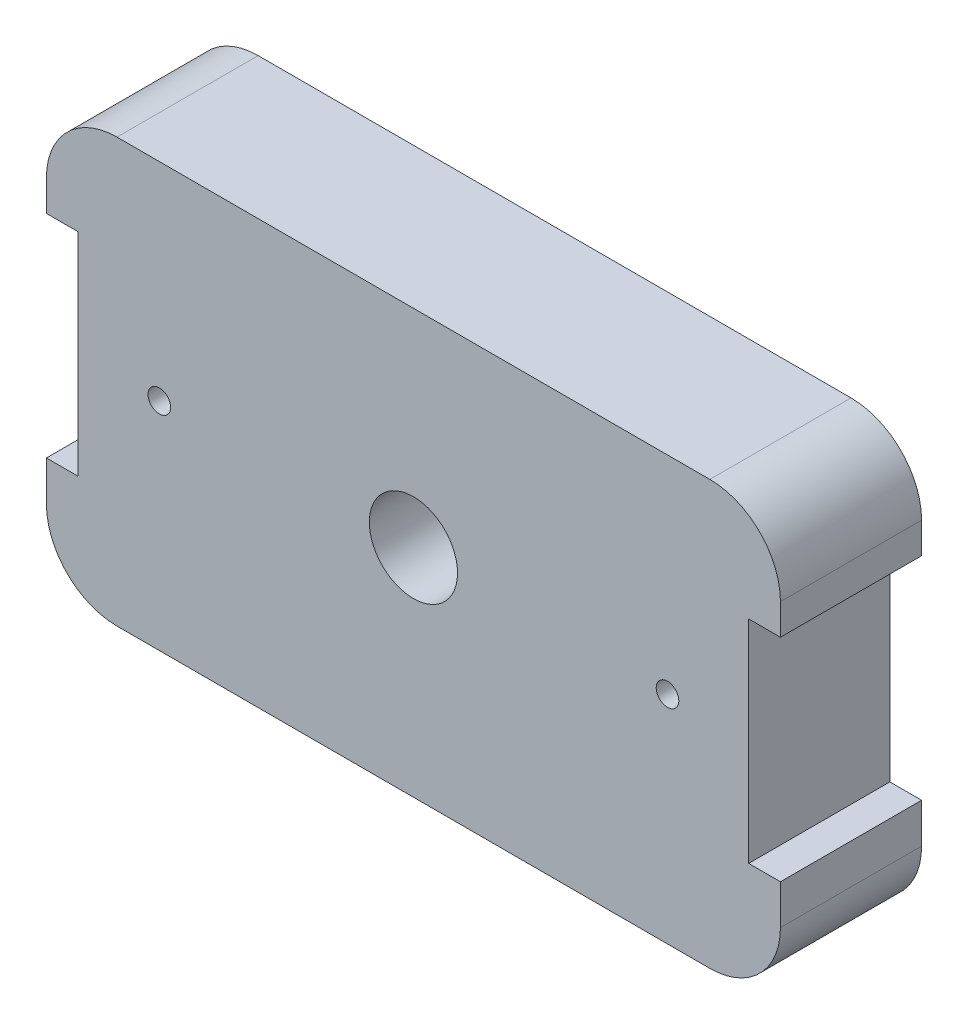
ISO-10303-21;
HEADER;
FILE_DESCRIPTION(('STEP AP214'),'2;1');
FILE_NAME('part.step','',(''),(''),'','','');
FILE_SCHEMA(('AUTOMOTIVE_DESIGN { 1 0 10303 214 1 1 1 1 }'));
ENDSEC;
DATA;
#1=APPLICATION_CONTEXT('core data for automotive mechanical design processes');
#2=APPLICATION_PROTOCOL_DEFINITION('international standard','automotive_design',2000,#1);
#3=PRODUCT_CONTEXT('',#1,'mechanical');
#4=PRODUCT('Part','Part','',(#3));
#5=PRODUCT_RELATED_PRODUCT_CATEGORY('part','',(#4));
#6=PRODUCT_DEFINITION_FORMATION('','',#4);
#7=PRODUCT_DEFINITION_CONTEXT('part definition',#1,'design');
#8=PRODUCT_DEFINITION('design','',#6,#7);
#9=PRODUCT_DEFINITION_SHAPE('','',#8);
#10=(LENGTH_UNIT() NAMED_UNIT(*) SI_UNIT(.MILLI.,.METRE.));
#11=(NAMED_UNIT(*) PLANE_ANGLE_UNIT() SI_UNIT($,.RADIAN.));
#12=(NAMED_UNIT(*) SI_UNIT($,.STERADIAN.) SOLID_ANGLE_UNIT());
#13=UNCERTAINTY_MEASURE_WITH_UNIT(LENGTH_MEASURE(1.E-05),#10,'distance_accuracy_value','');
#14=(GEOMETRIC_REPRESENTATION_CONTEXT(3) GLOBAL_UNCERTAINTY_ASSIGNED_CONTEXT((#13)) GLOBAL_UNIT_ASSIGNED_CONTEXT((#10,
#11,#12)) REPRESENTATION_CONTEXT('',''));
#15=CARTESIAN_POINT('',(0.,0.,0.));
#16=DIRECTION('',(0.,0.,1.));
#17=DIRECTION('',(1.,0.,0.));
#18=AXIS2_PLACEMENT_3D('',#15,#16,#17);
#19=CARTESIAN_POINT('',(52.0000000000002,0.,20.));
#20=DIRECTION('',(1.,0.,0.));
#21=DIRECTION('',(0.,0.,-1.));
#22=AXIS2_PLACEMENT_3D('',#19,#20,#21);
#23=PLANE('',#22);
#24=DIRECTION('',(0.,-1.,0.));
#25=VECTOR('',#24,1.);
#26=CARTESIAN_POINT('',(52.0000000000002,0.,0.));
#27=LINE('',#26,#25);
#28=CARTESIAN_POINT('',(52.0000000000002,19.3673925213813,0.));
#29=VERTEX_POINT('',#28);
#30=CARTESIAN_POINT('',(52.0000000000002,15.,0.));
#31=VERTEX_POINT('',#30);
#32=EDGE_CURVE('E203',#29,#31,#27,.T.);
#33=ORIENTED_EDGE('',*,*,#32,.F.);
#34=DIRECTION('',(0.,0.,-1.));
#35=VECTOR('',#34,1.);
#36=CARTESIAN_POINT('',(52.0000000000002,19.3673925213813,20.));
#37=LINE('',#36,#35);
#38=CARTESIAN_POINT('',(52.0000000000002,19.3673925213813,20.));
#39=VERTEX_POINT('',#38);
#40=EDGE_CURVE('E42',#29,#39,#37,.F.);
#41=ORIENTED_EDGE('',*,*,#40,.T.);
#42=DIRECTION('',(0.,-1.,0.));
#43=VECTOR('',#42,1.);
#44=CARTESIAN_POINT('',(52.0000000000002,0.,20.));
#45=LINE('',#44,#43);
#46=CARTESIAN_POINT('',(52.0000000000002,15.,20.));
#47=VERTEX_POINT('',#46);
#48=EDGE_CURVE('E284',#39,#47,#45,.T.);
#49=ORIENTED_EDGE('',*,*,#48,.T.);
#50=DIRECTION('',(0.,0.,-1.));
#51=VECTOR('',#50,1.);
#52=CARTESIAN_POINT('',(52.0000000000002,15.,20.));
#53=LINE('',#52,#51);
#54=EDGE_CURVE('E193',#47,#31,#53,.T.);
#55=ORIENTED_EDGE('',*,*,#54,.T.);
#56=EDGE_LOOP('',(#33,#41,#49,#55));
#57=FACE_BOUND('',#56,.T.);
#58=ADVANCED_FACE('F34',(#57),#23,.T.);
#59=CARTESIAN_POINT('',(0.,29.3673925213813,20.));
#60=DIRECTION('',(0.,1.,0.));
#61=DIRECTION('',(0.,0.,1.));
#62=AXIS2_PLACEMENT_3D('',#59,#60,#61);
#63=PLANE('',#62);
#64=DIRECTION('',(1.,0.,0.));
#65=VECTOR('',#64,1.);
#66=CARTESIAN_POINT('',(0.,29.3673925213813,20.));
#67=LINE('',#66,#65);
#68=CARTESIAN_POINT('',(-42.0000000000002,29.3673925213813,20.));
#69=VERTEX_POINT('',#68);
#70=CARTESIAN_POINT('',(42.0000000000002,29.3673925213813,20.));
#71=VERTEX_POINT('',#70);
#72=EDGE_CURVE('E166',#69,#71,#67,.T.);
#73=ORIENTED_EDGE('',*,*,#72,.T.);
#74=DIRECTION('',(0.,0.,-1.));
#75=VECTOR('',#74,1.);
#76=CARTESIAN_POINT('',(42.0000000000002,29.3673925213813,20.));
#77=LINE('',#76,#75);
#78=CARTESIAN_POINT('',(42.0000000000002,29.3673925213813,0.));
#79=VERTEX_POINT('',#78);
#80=EDGE_CURVE('E278',#71,#79,#77,.T.);
#81=ORIENTED_EDGE('',*,*,#80,.T.);
#82=DIRECTION('',(1.,0.,0.));
#83=VECTOR('',#82,1.);
#84=CARTESIAN_POINT('',(0.,29.3673925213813,0.));
#85=LINE('',#84,#83);
#86=CARTESIAN_POINT('',(-42.0000000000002,29.3673925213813,0.));
#87=VERTEX_POINT('',#86);
#88=EDGE_CURVE('E205',#87,#79,#85,.T.);
#89=ORIENTED_EDGE('',*,*,#88,.F.);
#90=DIRECTION('',(0.,0.,-1.));
#91=VECTOR('',#90,1.);
#92=CARTESIAN_POINT('',(-42.0000000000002,29.3673925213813,20.));
#93=LINE('',#92,#91);
#94=EDGE_CURVE('E276',#87,#69,#93,.F.);
#95=ORIENTED_EDGE('',*,*,#94,.T.);
#96=EDGE_LOOP('',(#73,#81,#89,#95));
#97=FACE_BOUND('',#96,.T.);
#98=ADVANCED_FACE('F295',(#97),#63,.T.);
#99=CARTESIAN_POINT('',(-52.0000000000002,0.,20.));
#100=DIRECTION('',(-1.,0.,0.));
#101=DIRECTION('',(0.,0.,1.));
#102=AXIS2_PLACEMENT_3D('',#99,#100,#101);
#103=PLANE('',#102);
#104=DIRECTION('',(0.,1.,0.));
#105=VECTOR('',#104,1.);
#106=CARTESIAN_POINT('',(-52.0000000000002,0.,20.));
#107=LINE('',#106,#105);
#108=CARTESIAN_POINT('',(-52.0000000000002,15.,20.));
#109=VERTEX_POINT('',#108);
#110=CARTESIAN_POINT('',(-52.0000000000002,19.3673925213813,20.));
#111=VERTEX_POINT('',#110);
#112=EDGE_CURVE('E150',#109,#111,#107,.T.);
#113=ORIENTED_EDGE('',*,*,#112,.T.);
#114=DIRECTION('',(0.,0.,-1.));
#115=VECTOR('',#114,1.);
#116=CARTESIAN_POINT('',(-52.0000000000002,19.3673925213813,20.));
#117=LINE('',#116,#115);
#118=CARTESIAN_POINT('',(-52.0000000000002,19.3673925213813,0.));
#119=VERTEX_POINT('',#118);
#120=EDGE_CURVE('E11',#111,#119,#117,.T.);
#121=ORIENTED_EDGE('',*,*,#120,.T.);
#122=DIRECTION('',(0.,1.,0.));
#123=VECTOR('',#122,1.);
#124=CARTESIAN_POINT('',(-52.0000000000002,0.,0.));
#125=LINE('',#124,#123);
#126=CARTESIAN_POINT('',(-52.0000000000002,15.,0.));
#127=VERTEX_POINT('',#126);
#128=EDGE_CURVE('E153',#127,#119,#125,.T.);
#129=ORIENTED_EDGE('',*,*,#128,.F.);
#130=DIRECTION('',(0.,0.,-1.));
#131=VECTOR('',#130,1.);
#132=CARTESIAN_POINT('',(-52.0000000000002,15.,20.));
#133=LINE('',#132,#131);
#134=EDGE_CURVE('E148',#109,#127,#133,.T.);
#135=ORIENTED_EDGE('',*,*,#134,.F.);
#136=EDGE_LOOP('',(#113,#121,#129,#135));
#137=FACE_BOUND('',#136,.T.);
#138=ADVANCED_FACE('F149',(#137),#103,.T.);
#139=CARTESIAN_POINT('',(0.,15.,20.));
#140=DIRECTION('',(0.,-1.,0.));
#141=DIRECTION('',(0.,0.,-1.));
#142=AXIS2_PLACEMENT_3D('',#139,#140,#141);
#143=PLANE('',#142);
#144=DIRECTION('',(-1.,0.,0.));
#145=VECTOR('',#144,1.);
#146=CARTESIAN_POINT('',(0.,15.,0.));
#147=LINE('',#146,#145);
#148=CARTESIAN_POINT('',(-47.5000000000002,15.,0.));
#149=VERTEX_POINT('',#148);
#150=EDGE_CURVE('E209',#149,#127,#147,.T.);
#151=ORIENTED_EDGE('',*,*,#150,.F.);
#152=DIRECTION('',(0.,0.,-1.));
#153=VECTOR('',#152,1.);
#154=CARTESIAN_POINT('',(-47.5000000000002,15.,20.));
#155=LINE('',#154,#153);
#156=CARTESIAN_POINT('',(-47.5000000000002,15.,20.));
#157=VERTEX_POINT('',#156);
#158=EDGE_CURVE('E159',#157,#149,#155,.T.);
#159=ORIENTED_EDGE('',*,*,#158,.F.);
#160=DIRECTION('',(-1.,0.,0.));
#161=VECTOR('',#160,1.);
#162=CARTESIAN_POINT('',(0.,15.,20.));
#163=LINE('',#162,#161);
#164=EDGE_CURVE('E165',#157,#109,#163,.T.);
#165=ORIENTED_EDGE('',*,*,#164,.T.);
#166=ORIENTED_EDGE('',*,*,#134,.T.);
#167=EDGE_LOOP('',(#151,#159,#165,#166));
#168=FACE_BOUND('',#167,.T.);
#169=ADVANCED_FACE('F168',(#168),#143,.T.);
#170=CARTESIAN_POINT('',(-47.5000000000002,0.,20.));
#171=DIRECTION('',(1.,0.,0.));
#172=DIRECTION('',(0.,0.,-1.));
#173=AXIS2_PLACEMENT_3D('',#170,#171,#172);
#174=PLANE('',#173);
#175=DIRECTION('',(0.,-1.,0.));
#176=VECTOR('',#175,1.);
#177=CARTESIAN_POINT('',(-47.5000000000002,0.,0.));
#178=LINE('',#177,#176);
#179=CARTESIAN_POINT('',(-47.5000000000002,-15.,0.));
#180=VERTEX_POINT('',#179);
#181=EDGE_CURVE('E211',#149,#180,#178,.T.);
#182=ORIENTED_EDGE('',*,*,#181,.T.);
#183=DIRECTION('',(0.,0.,-1.));
#184=VECTOR('',#183,1.);
#185=CARTESIAN_POINT('',(-47.5000000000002,-15.,20.));
#186=LINE('',#185,#184);
#187=CARTESIAN_POINT('',(-47.5000000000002,-15.,20.));
#188=VERTEX_POINT('',#187);
#189=EDGE_CURVE('E249',#188,#180,#186,.T.);
#190=ORIENTED_EDGE('',*,*,#189,.F.);
#191=DIRECTION('',(0.,-1.,0.));
#192=VECTOR('',#191,1.);
#193=CARTESIAN_POINT('',(-47.5000000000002,0.,20.));
#194=LINE('',#193,#192);
#195=EDGE_CURVE('E170',#157,#188,#194,.T.);
#196=ORIENTED_EDGE('',*,*,#195,.F.);
#197=ORIENTED_EDGE('',*,*,#158,.T.);
#198=EDGE_LOOP('',(#182,#190,#196,#197));
#199=FACE_BOUND('',#198,.T.);
#200=ADVANCED_FACE('F492',(#199),#174,.F.);
#201=CARTESIAN_POINT('',(0.,-15.,20.));
#202=DIRECTION('',(0.,-1.,0.));
#203=DIRECTION('',(0.,0.,-1.));
#204=AXIS2_PLACEMENT_3D('',#201,#202,#203);
#205=PLANE('',#204);
#206=DIRECTION('',(-1.,0.,0.));
#207=VECTOR('',#206,1.);
#208=CARTESIAN_POINT('',(0.,-15.,0.));
#209=LINE('',#208,#207);
#210=CARTESIAN_POINT('',(-52.0000000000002,-15.,0.));
#211=VERTEX_POINT('',#210);
#212=EDGE_CURVE('E214',#180,#211,#209,.T.);
#213=ORIENTED_EDGE('',*,*,#212,.T.);
#214=DIRECTION('',(0.,0.,-1.));
#215=VECTOR('',#214,1.);
#216=CARTESIAN_POINT('',(-52.0000000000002,-15.,20.));
#217=LINE('',#216,#215);
#218=CARTESIAN_POINT('',(-52.0000000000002,-15.,20.));
#219=VERTEX_POINT('',#218);
#220=EDGE_CURVE('E246',#219,#211,#217,.T.);
#221=ORIENTED_EDGE('',*,*,#220,.F.);
#222=DIRECTION('',(-1.,0.,0.));
#223=VECTOR('',#222,1.);
#224=CARTESIAN_POINT('',(0.,-15.,20.));
#225=LINE('',#224,#223);
#226=EDGE_CURVE('E172',#188,#219,#225,.T.);
#227=ORIENTED_EDGE('',*,*,#226,.F.);
#228=ORIENTED_EDGE('',*,*,#189,.T.);
#229=EDGE_LOOP('',(#213,#221,#227,#228));
#230=FACE_BOUND('',#229,.T.);
#231=ADVANCED_FACE('F423',(#230),#205,.F.);
#232=CARTESIAN_POINT('',(-52.0000000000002,0.,20.));
#233=DIRECTION('',(1.,0.,0.));
#234=DIRECTION('',(0.,0.,-1.));
#235=AXIS2_PLACEMENT_3D('',#232,#233,#234);
#236=PLANE('',#235);
#237=DIRECTION('',(0.,-1.,0.));
#238=VECTOR('',#237,1.);
#239=CARTESIAN_POINT('',(-52.0000000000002,0.,0.));
#240=LINE('',#239,#238);
#241=CARTESIAN_POINT('',(-52.0000000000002,-20.6326074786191,0.));
#242=VERTEX_POINT('',#241);
#243=EDGE_CURVE('E217',#211,#242,#240,.T.);
#244=ORIENTED_EDGE('',*,*,#243,.T.);
#245=DIRECTION('',(0.,0.,-1.));
#246=VECTOR('',#245,1.);
#247=CARTESIAN_POINT('',(-52.0000000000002,-20.6326074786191,20.));
#248=LINE('',#247,#246);
#249=CARTESIAN_POINT('',(-52.0000000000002,-20.6326074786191,20.));
#250=VERTEX_POINT('',#249);
#251=EDGE_CURVE('E265',#242,#250,#248,.F.);
#252=ORIENTED_EDGE('',*,*,#251,.T.);
#253=DIRECTION('',(0.,-1.,0.));
#254=VECTOR('',#253,1.);
#255=CARTESIAN_POINT('',(-52.0000000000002,0.,20.));
#256=LINE('',#255,#254);
#257=EDGE_CURVE('E178',#219,#250,#256,.T.);
#258=ORIENTED_EDGE('',*,*,#257,.F.);
#259=ORIENTED_EDGE('',*,*,#220,.T.);
#260=EDGE_LOOP('',(#244,#252,#258,#259));
#261=FACE_BOUND('',#260,.T.);
#262=ADVANCED_FACE('F413',(#261),#236,.F.);
#263=CARTESIAN_POINT('',(0.,-30.6326074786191,20.));
#264=DIRECTION('',(0.,1.,0.));
#265=DIRECTION('',(-1.,0.,0.));
#266=AXIS2_PLACEMENT_3D('',#263,#264,#265);
#267=PLANE('',#266);
#268=DIRECTION('',(1.,0.,0.));
#269=VECTOR('',#268,1.);
#270=CARTESIAN_POINT('',(0.,-30.6326074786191,20.));
#271=LINE('',#270,#269);
#272=CARTESIAN_POINT('',(-42.0000000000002,-30.6326074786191,20.));
#273=VERTEX_POINT('',#272);
#274=CARTESIAN_POINT('',(41.9999999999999,-30.6326074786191,20.));
#275=VERTEX_POINT('',#274);
#276=EDGE_CURVE('E180',#273,#275,#271,.T.);
#277=ORIENTED_EDGE('',*,*,#276,.F.);
#278=DIRECTION('',(0.,0.,-1.));
#279=VECTOR('',#278,1.);
#280=CARTESIAN_POINT('',(-42.0000000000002,-30.6326074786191,20.));
#281=LINE('',#280,#279);
#282=CARTESIAN_POINT('',(-42.0000000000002,-30.6326074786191,0.));
#283=VERTEX_POINT('',#282);
#284=EDGE_CURVE('E254',#273,#283,#281,.T.);
#285=ORIENTED_EDGE('',*,*,#284,.T.);
#286=DIRECTION('',(1.,0.,0.));
#287=VECTOR('',#286,1.);
#288=CARTESIAN_POINT('',(0.,-30.6326074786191,0.));
#289=LINE('',#288,#287);
#290=CARTESIAN_POINT('',(41.9999999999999,-30.6326074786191,0.));
#291=VERTEX_POINT('',#290);
#292=EDGE_CURVE('E220',#283,#291,#289,.T.);
#293=ORIENTED_EDGE('',*,*,#292,.T.);
#294=DIRECTION('',(0.,0.,-1.));
#295=VECTOR('',#294,1.);
#296=CARTESIAN_POINT('',(41.9999999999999,-30.6326074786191,20.));
#297=LINE('',#296,#295);
#298=EDGE_CURVE('E158',#291,#275,#297,.F.);
#299=ORIENTED_EDGE('',*,*,#298,.T.);
#300=EDGE_LOOP('',(#277,#285,#293,#299));
#301=FACE_BOUND('',#300,.T.);
#302=ADVANCED_FACE('F401',(#301),#267,.F.);
#303=CARTESIAN_POINT('',(51.9999999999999,0.,20.));
#304=DIRECTION('',(-1.,0.,0.));
#305=DIRECTION('',(0.,0.,1.));
#306=AXIS2_PLACEMENT_3D('',#303,#304,#305);
#307=PLANE('',#306);
#308=DIRECTION('',(0.,1.,0.));
#309=VECTOR('',#308,1.);
#310=CARTESIAN_POINT('',(51.9999999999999,0.,20.));
#311=LINE('',#310,#309);
#312=CARTESIAN_POINT('',(51.9999999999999,-20.6326074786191,20.));
#313=VERTEX_POINT('',#312);
#314=CARTESIAN_POINT('',(51.9999999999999,-15.,20.));
#315=VERTEX_POINT('',#314);
#316=EDGE_CURVE('E182',#313,#315,#311,.T.);
#317=ORIENTED_EDGE('',*,*,#316,.F.);
#318=DIRECTION('',(0.,0.,-1.));
#319=VECTOR('',#318,1.);
#320=CARTESIAN_POINT('',(51.9999999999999,-20.6326074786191,20.));
#321=LINE('',#320,#319);
#322=CARTESIAN_POINT('',(51.9999999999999,-20.6326074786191,0.));
#323=VERTEX_POINT('',#322);
#324=EDGE_CURVE('E273',#313,#323,#321,.T.);
#325=ORIENTED_EDGE('',*,*,#324,.T.);
#326=DIRECTION('',(0.,1.,0.));
#327=VECTOR('',#326,1.);
#328=CARTESIAN_POINT('',(51.9999999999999,0.,0.));
#329=LINE('',#328,#327);
#330=CARTESIAN_POINT('',(51.9999999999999,-15.,0.));
#331=VERTEX_POINT('',#330);
#332=EDGE_CURVE('E223',#323,#331,#329,.T.);
#333=ORIENTED_EDGE('',*,*,#332,.T.);
#334=DIRECTION('',(0.,0.,-1.));
#335=VECTOR('',#334,1.);
#336=CARTESIAN_POINT('',(51.9999999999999,-15.,20.));
#337=LINE('',#336,#335);
#338=EDGE_CURVE('E243',#315,#331,#337,.T.);
#339=ORIENTED_EDGE('',*,*,#338,.F.);
#340=EDGE_LOOP('',(#317,#325,#333,#339));
#341=FACE_BOUND('',#340,.T.);
#342=ADVANCED_FACE('F395',(#341),#307,.F.);
#343=CARTESIAN_POINT('',(0.,-15.,20.));
#344=DIRECTION('',(0.,-1.,0.));
#345=DIRECTION('',(0.,0.,-1.));
#346=AXIS2_PLACEMENT_3D('',#343,#344,#345);
#347=PLANE('',#346);
#348=DIRECTION('',(-1.,0.,0.));
#349=VECTOR('',#348,1.);
#350=CARTESIAN_POINT('',(0.,-15.,0.));
#351=LINE('',#350,#349);
#352=CARTESIAN_POINT('',(47.4999999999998,-15.,0.));
#353=VERTEX_POINT('',#352);
#354=EDGE_CURVE('E225',#331,#353,#351,.T.);
#355=ORIENTED_EDGE('',*,*,#354,.T.);
#356=DIRECTION('',(0.,0.,-1.));
#357=VECTOR('',#356,1.);
#358=CARTESIAN_POINT('',(47.4999999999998,-15.,20.));
#359=LINE('',#358,#357);
#360=CARTESIAN_POINT('',(47.4999999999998,-15.,20.));
#361=VERTEX_POINT('',#360);
#362=EDGE_CURVE('E240',#361,#353,#359,.T.);
#363=ORIENTED_EDGE('',*,*,#362,.F.);
#364=DIRECTION('',(-1.,0.,0.));
#365=VECTOR('',#364,1.);
#366=CARTESIAN_POINT('',(0.,-15.,20.));
#367=LINE('',#366,#365);
#368=EDGE_CURVE('E184',#315,#361,#367,.T.);
#369=ORIENTED_EDGE('',*,*,#368,.F.);
#370=ORIENTED_EDGE('',*,*,#338,.T.);
#371=EDGE_LOOP('',(#355,#363,#369,#370));
#372=FACE_BOUND('',#371,.T.);
#373=ADVANCED_FACE('F400',(#372),#347,.F.);
#374=CARTESIAN_POINT('',(47.4999999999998,0.,20.));
#375=DIRECTION('',(-1.,0.,0.));
#376=DIRECTION('',(0.,0.,1.));
#377=AXIS2_PLACEMENT_3D('',#374,#375,#376);
#378=PLANE('',#377);
#379=DIRECTION('',(0.,1.,0.));
#380=VECTOR('',#379,1.);
#381=CARTESIAN_POINT('',(47.4999999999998,0.,0.));
#382=LINE('',#381,#380);
#383=CARTESIAN_POINT('',(47.4999999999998,15.,0.));
#384=VERTEX_POINT('',#383);
#385=EDGE_CURVE('E228',#353,#384,#382,.T.);
#386=ORIENTED_EDGE('',*,*,#385,.T.);
#387=DIRECTION('',(0.,0.,-1.));
#388=VECTOR('',#387,1.);
#389=CARTESIAN_POINT('',(47.4999999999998,15.,20.));
#390=LINE('',#389,#388);
#391=CARTESIAN_POINT('',(47.4999999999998,15.,20.));
#392=VERTEX_POINT('',#391);
#393=EDGE_CURVE('E237',#392,#384,#390,.T.);
#394=ORIENTED_EDGE('',*,*,#393,.F.);
#395=DIRECTION('',(0.,1.,0.));
#396=VECTOR('',#395,1.);
#397=CARTESIAN_POINT('',(47.4999999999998,0.,20.));
#398=LINE('',#397,#396);
#399=EDGE_CURVE('E187',#361,#392,#398,.T.);
#400=ORIENTED_EDGE('',*,*,#399,.F.);
#401=ORIENTED_EDGE('',*,*,#362,.T.);
#402=EDGE_LOOP('',(#386,#394,#400,#401));
#403=FACE_BOUND('',#402,.T.);
#404=ADVANCED_FACE('F325',(#403),#378,.F.);
#405=CARTESIAN_POINT('',(36.,0.,20.));
#406=DIRECTION('',(0.,0.,-1.));
#407=DIRECTION('',(-1.,0.,0.));
#408=AXIS2_PLACEMENT_3D('',#405,#406,#407);
#409=CYLINDRICAL_SURFACE('',#408,1.6);
#410=CARTESIAN_POINT('',(36.,0.,20.));
#411=DIRECTION('',(0.,0.,1.));
#412=DIRECTION('',(1.,0.,0.));
#413=AXIS2_PLACEMENT_3D('',#410,#411,#412);
#414=CIRCLE('',#413,1.6);
#415=CARTESIAN_POINT('',(37.6,0.,20.));
#416=VERTEX_POINT('',#415);
#417=EDGE_CURVE('E289',#416,#416,#414,.T.);
#418=ORIENTED_EDGE('',*,*,#417,.T.);
#419=EDGE_LOOP('',(#418));
#420=FACE_BOUND('',#419,.T.);
#421=CARTESIAN_POINT('',(36.,0.,0.));
#422=DIRECTION('',(0.,0.,1.));
#423=DIRECTION('',(1.,0.,0.));
#424=AXIS2_PLACEMENT_3D('',#421,#422,#423);
#425=CIRCLE('',#424,1.6);
#426=CARTESIAN_POINT('',(37.6,0.,0.));
#427=VERTEX_POINT('',#426);
#428=EDGE_CURVE('E200',#427,#427,#425,.T.);
#429=ORIENTED_EDGE('',*,*,#428,.F.);
#430=EDGE_LOOP('',(#429));
#431=FACE_BOUND('',#430,.T.);
#432=ADVANCED_FACE('F321',(#420,#431),#409,.F.);
#433=CARTESIAN_POINT('',(-36.,0.,20.));
#434=DIRECTION('',(0.,0.,-1.));
#435=DIRECTION('',(-1.,0.,0.));
#436=AXIS2_PLACEMENT_3D('',#433,#434,#435);
#437=CYLINDRICAL_SURFACE('',#436,1.6);
#438=CARTESIAN_POINT('',(-36.,0.,20.));
#439=DIRECTION('',(0.,0.,1.));
#440=DIRECTION('',(1.,0.,0.));
#441=AXIS2_PLACEMENT_3D('',#438,#439,#440);
#442=CIRCLE('',#441,1.6);
#443=CARTESIAN_POINT('',(-34.4,0.,20.));
#444=VERTEX_POINT('',#443);
#445=EDGE_CURVE('E304',#444,#444,#442,.T.);
#446=ORIENTED_EDGE('',*,*,#445,.T.);
#447=EDGE_LOOP('',(#446));
#448=FACE_BOUND('',#447,.T.);
#449=CARTESIAN_POINT('',(-36.,0.,0.));
#450=DIRECTION('',(0.,0.,1.));
#451=DIRECTION('',(1.,0.,0.));
#452=AXIS2_PLACEMENT_3D('',#449,#450,#451);
#453=CIRCLE('',#452,1.6);
#454=CARTESIAN_POINT('',(-34.4,0.,0.));
#455=VERTEX_POINT('',#454);
#456=EDGE_CURVE('E197',#455,#455,#453,.T.);
#457=ORIENTED_EDGE('',*,*,#456,.F.);
#458=EDGE_LOOP('',(#457));
#459=FACE_BOUND('',#458,.T.);
#460=ADVANCED_FACE('F324',(#448,#459),#437,.F.);
#461=CARTESIAN_POINT('',(0.,0.,20.));
#462=DIRECTION('',(0.,0.,-1.));
#463=DIRECTION('',(-1.,0.,0.));
#464=AXIS2_PLACEMENT_3D('',#461,#462,#463);
#465=CYLINDRICAL_SURFACE('',#464,6.25);
#466=CARTESIAN_POINT('',(0.,0.,20.));
#467=DIRECTION('',(0.,0.,1.));
#468=DIRECTION('',(1.,0.,0.));
#469=AXIS2_PLACEMENT_3D('',#466,#467,#468);
#470=CIRCLE('',#469,6.25);
#471=CARTESIAN_POINT('',(6.25,0.,20.));
#472=VERTEX_POINT('',#471);
#473=EDGE_CURVE('E234',#472,#472,#470,.T.);
#474=ORIENTED_EDGE('',*,*,#473,.T.);
#475=EDGE_LOOP('',(#474));
#476=FACE_BOUND('',#475,.T.);
#477=CARTESIAN_POINT('',(0.,0.,0.));
#478=DIRECTION('',(0.,0.,1.));
#479=DIRECTION('',(1.,0.,0.));
#480=AXIS2_PLACEMENT_3D('',#477,#478,#479);
#481=CIRCLE('',#480,6.25);
#482=CARTESIAN_POINT('',(6.25,0.,0.));
#483=VERTEX_POINT('',#482);
#484=EDGE_CURVE('E194',#483,#483,#481,.T.);
#485=ORIENTED_EDGE('',*,*,#484,.F.);
#486=EDGE_LOOP('',(#485));
#487=FACE_BOUND('',#486,.T.);
#488=ADVANCED_FACE('F310',(#476,#487),#465,.F.);
#489=CARTESIAN_POINT('',(0.,15.,20.));
#490=DIRECTION('',(0.,1.,0.));
#491=DIRECTION('',(0.,0.,1.));
#492=AXIS2_PLACEMENT_3D('',#489,#490,#491);
#493=PLANE('',#492);
#494=DIRECTION('',(1.,0.,0.));
#495=VECTOR('',#494,1.);
#496=CARTESIAN_POINT('',(0.,15.,0.));
#497=LINE('',#496,#495);
#498=EDGE_CURVE('E231',#384,#31,#497,.T.);
#499=ORIENTED_EDGE('',*,*,#498,.T.);
#500=ORIENTED_EDGE('',*,*,#54,.F.);
#501=DIRECTION('',(1.,0.,0.));
#502=VECTOR('',#501,1.);
#503=CARTESIAN_POINT('',(0.,15.,20.));
#504=LINE('',#503,#502);
#505=EDGE_CURVE('E190',#392,#47,#504,.T.);
#506=ORIENTED_EDGE('',*,*,#505,.F.);
#507=ORIENTED_EDGE('',*,*,#393,.T.);
#508=EDGE_LOOP('',(#499,#500,#506,#507));
#509=FACE_BOUND('',#508,.T.);
#510=ADVANCED_FACE('F315',(#509),#493,.F.);
#511=CARTESIAN_POINT('',(0.,0.,20.));
#512=DIRECTION('',(0.,0.,1.));
#513=DIRECTION('',(1.,0.,0.));
#514=AXIS2_PLACEMENT_3D('',#511,#512,#513);
#515=PLANE('',#514);
#516=ORIENTED_EDGE('',*,*,#473,.F.);
#517=EDGE_LOOP('',(#516));
#518=FACE_BOUND('',#517,.T.);
#519=ORIENTED_EDGE('',*,*,#445,.F.);
#520=EDGE_LOOP('',(#519));
#521=FACE_BOUND('',#520,.T.);
#522=ORIENTED_EDGE('',*,*,#417,.F.);
#523=EDGE_LOOP('',(#522));
#524=FACE_BOUND('',#523,.T.);
#525=ORIENTED_EDGE('',*,*,#257,.T.);
#526=CARTESIAN_POINT('',(-42.0000000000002,-20.6326074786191,20.));
#527=DIRECTION('',(0.,0.,1.));
#528=DIRECTION('',(1.,0.,0.));
#529=AXIS2_PLACEMENT_3D('',#526,#527,#528);
#530=CIRCLE('',#529,10.);
#531=EDGE_CURVE('E271',#250,#273,#530,.T.);
#532=ORIENTED_EDGE('',*,*,#531,.T.);
#533=ORIENTED_EDGE('',*,*,#276,.T.);
#534=CARTESIAN_POINT('',(41.9999999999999,-20.6326074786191,20.));
#535=DIRECTION('',(0.,0.,1.));
#536=DIRECTION('',(1.,0.,0.));
#537=AXIS2_PLACEMENT_3D('',#534,#535,#536);
#538=CIRCLE('',#537,10.);
#539=EDGE_CURVE('E49',#275,#313,#538,.T.);
#540=ORIENTED_EDGE('',*,*,#539,.T.);
#541=ORIENTED_EDGE('',*,*,#316,.T.);
#542=ORIENTED_EDGE('',*,*,#368,.T.);
#543=ORIENTED_EDGE('',*,*,#399,.T.);
#544=ORIENTED_EDGE('',*,*,#505,.T.);
#545=ORIENTED_EDGE('',*,*,#48,.F.);
#546=CARTESIAN_POINT('',(42.0000000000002,19.3673925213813,20.));
#547=DIRECTION('',(0.,0.,1.));
#548=DIRECTION('',(1.,0.,0.));
#549=AXIS2_PLACEMENT_3D('',#546,#547,#548);
#550=CIRCLE('',#549,10.);
#551=EDGE_CURVE('E268',#39,#71,#550,.T.);
#552=ORIENTED_EDGE('',*,*,#551,.T.);
#553=ORIENTED_EDGE('',*,*,#72,.F.);
#554=CARTESIAN_POINT('',(-42.0000000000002,19.3673925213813,20.));
#555=DIRECTION('',(0.,0.,1.));
#556=DIRECTION('',(1.,0.,0.));
#557=AXIS2_PLACEMENT_3D('',#554,#555,#556);
#558=CIRCLE('',#557,10.);
#559=EDGE_CURVE('E56',#69,#111,#558,.T.);
#560=ORIENTED_EDGE('',*,*,#559,.T.);
#561=ORIENTED_EDGE('',*,*,#112,.F.);
#562=ORIENTED_EDGE('',*,*,#164,.F.);
#563=ORIENTED_EDGE('',*,*,#195,.T.);
#564=ORIENTED_EDGE('',*,*,#226,.T.);
#565=EDGE_LOOP('',(#525,#532,#533,#540,#541,#542,#543,#544,#545,#552,#553,#560,#561,#562,#563,#564));
#566=FACE_BOUND('',#565,.T.);
#567=ADVANCED_FACE('F163',(#518,#521,#524,#566),#515,.T.);
#568=CARTESIAN_POINT('',(0.,0.,0.));
#569=DIRECTION('',(0.,0.,1.));
#570=DIRECTION('',(1.,0.,0.));
#571=AXIS2_PLACEMENT_3D('',#568,#569,#570);
#572=PLANE('',#571);
#573=ORIENTED_EDGE('',*,*,#484,.T.);
#574=EDGE_LOOP('',(#573));
#575=FACE_BOUND('',#574,.T.);
#576=ORIENTED_EDGE('',*,*,#456,.T.);
#577=EDGE_LOOP('',(#576));
#578=FACE_BOUND('',#577,.T.);
#579=ORIENTED_EDGE('',*,*,#428,.T.);
#580=EDGE_LOOP('',(#579));
#581=FACE_BOUND('',#580,.T.);
#582=ORIENTED_EDGE('',*,*,#292,.F.);
#583=CARTESIAN_POINT('',(-42.0000000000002,-20.6326074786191,0.));
#584=DIRECTION('',(0.,0.,1.));
#585=DIRECTION('',(1.,0.,0.));
#586=AXIS2_PLACEMENT_3D('',#583,#584,#585);
#587=CIRCLE('',#586,10.);
#588=EDGE_CURVE('E263',#283,#242,#587,.F.);
#589=ORIENTED_EDGE('',*,*,#588,.T.);
#590=ORIENTED_EDGE('',*,*,#243,.F.);
#591=ORIENTED_EDGE('',*,*,#212,.F.);
#592=ORIENTED_EDGE('',*,*,#181,.F.);
#593=ORIENTED_EDGE('',*,*,#150,.T.);
#594=ORIENTED_EDGE('',*,*,#128,.T.);
#595=CARTESIAN_POINT('',(-42.0000000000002,19.3673925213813,0.));
#596=DIRECTION('',(0.,0.,1.));
#597=DIRECTION('',(1.,0.,0.));
#598=AXIS2_PLACEMENT_3D('',#595,#596,#597);
#599=CIRCLE('',#598,10.);
#600=EDGE_CURVE('E257',#119,#87,#599,.F.);
#601=ORIENTED_EDGE('',*,*,#600,.T.);
#602=ORIENTED_EDGE('',*,*,#88,.T.);
#603=CARTESIAN_POINT('',(42.0000000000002,19.3673925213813,0.));
#604=DIRECTION('',(0.,0.,1.));
#605=DIRECTION('',(1.,0.,0.));
#606=AXIS2_PLACEMENT_3D('',#603,#604,#605);
#607=CIRCLE('',#606,10.);
#608=EDGE_CURVE('E259',#79,#29,#607,.F.);
#609=ORIENTED_EDGE('',*,*,#608,.T.);
#610=ORIENTED_EDGE('',*,*,#32,.T.);
#611=ORIENTED_EDGE('',*,*,#498,.F.);
#612=ORIENTED_EDGE('',*,*,#385,.F.);
#613=ORIENTED_EDGE('',*,*,#354,.F.);
#614=ORIENTED_EDGE('',*,*,#332,.F.);
#615=CARTESIAN_POINT('',(41.9999999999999,-20.6326074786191,0.));
#616=DIRECTION('',(0.,0.,1.));
#617=DIRECTION('',(1.,0.,0.));
#618=AXIS2_PLACEMENT_3D('',#615,#616,#617);
#619=CIRCLE('',#618,10.);
#620=EDGE_CURVE('E261',#323,#291,#619,.F.);
#621=ORIENTED_EDGE('',*,*,#620,.T.);
#622=EDGE_LOOP('',(#582,#589,#590,#591,#592,#593,#594,#601,#602,#609,#610,#611,#612,#613,#614,#621));
#623=FACE_BOUND('',#622,.T.);
#624=ADVANCED_FACE('F299',(#575,#578,#581,#623),#572,.F.);
#625=CARTESIAN_POINT('',(-42.0000000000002,-20.6326074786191,20.));
#626=DIRECTION('',(0.,0.,-1.));
#627=DIRECTION('',(-1.,0.,0.));
#628=AXIS2_PLACEMENT_3D('',#625,#626,#627);
#629=CYLINDRICAL_SURFACE('',#628,10.);
#630=ORIENTED_EDGE('',*,*,#531,.F.);
#631=ORIENTED_EDGE('',*,*,#251,.F.);
#632=ORIENTED_EDGE('',*,*,#588,.F.);
#633=ORIENTED_EDGE('',*,*,#284,.F.);
#634=EDGE_LOOP('',(#630,#631,#632,#633));
#635=FACE_BOUND('',#634,.T.);
#636=ADVANCED_FACE('F330',(#635),#629,.T.);
#637=CARTESIAN_POINT('',(41.9999999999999,-20.6326074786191,20.));
#638=DIRECTION('',(0.,0.,-1.));
#639=DIRECTION('',(-1.,0.,0.));
#640=AXIS2_PLACEMENT_3D('',#637,#638,#639);
#641=CYLINDRICAL_SURFACE('',#640,10.);
#642=ORIENTED_EDGE('',*,*,#539,.F.);
#643=ORIENTED_EDGE('',*,*,#298,.F.);
#644=ORIENTED_EDGE('',*,*,#620,.F.);
#645=ORIENTED_EDGE('',*,*,#324,.F.);
#646=EDGE_LOOP('',(#642,#643,#644,#645));
#647=FACE_BOUND('',#646,.T.);
#648=ADVANCED_FACE('F336',(#647),#641,.T.);
#649=CARTESIAN_POINT('',(42.0000000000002,19.3673925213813,20.));
#650=DIRECTION('',(0.,0.,-1.));
#651=DIRECTION('',(-1.,0.,0.));
#652=AXIS2_PLACEMENT_3D('',#649,#650,#651);
#653=CYLINDRICAL_SURFACE('',#652,10.);
#654=ORIENTED_EDGE('',*,*,#551,.F.);
#655=ORIENTED_EDGE('',*,*,#40,.F.);
#656=ORIENTED_EDGE('',*,*,#608,.F.);
#657=ORIENTED_EDGE('',*,*,#80,.F.);
#658=EDGE_LOOP('',(#654,#655,#656,#657));
#659=FACE_BOUND('',#658,.T.);
#660=ADVANCED_FACE('F292',(#659),#653,.T.);
#661=CARTESIAN_POINT('',(-42.0000000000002,19.3673925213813,20.));
#662=DIRECTION('',(0.,0.,-1.));
#663=DIRECTION('',(-1.,0.,0.));
#664=AXIS2_PLACEMENT_3D('',#661,#662,#663);
#665=CYLINDRICAL_SURFACE('',#664,10.);
#666=ORIENTED_EDGE('',*,*,#559,.F.);
#667=ORIENTED_EDGE('',*,*,#94,.F.);
#668=ORIENTED_EDGE('',*,*,#600,.F.);
#669=ORIENTED_EDGE('',*,*,#120,.F.);
#670=EDGE_LOOP('',(#666,#667,#668,#669));
#671=FACE_BOUND('',#670,.T.);
#672=ADVANCED_FACE('F36',(#671),#665,.T.);
#673=CLOSED_SHELL('',(#58,#98,#138,#169,#200,#231,#262,#302,#342,#373,#404,#432,#460,#488,#510,
#567,#624,#636,#648,#660,#672));
#674=MANIFOLD_SOLID_BREP('B2',#673);
#675=ADVANCED_BREP_SHAPE_REPRESENTATION('',(#18,#674),#14);
#676=SHAPE_DEFINITION_REPRESENTATION(#9,#675);
ENDSEC;
END-ISO-10303-21;
